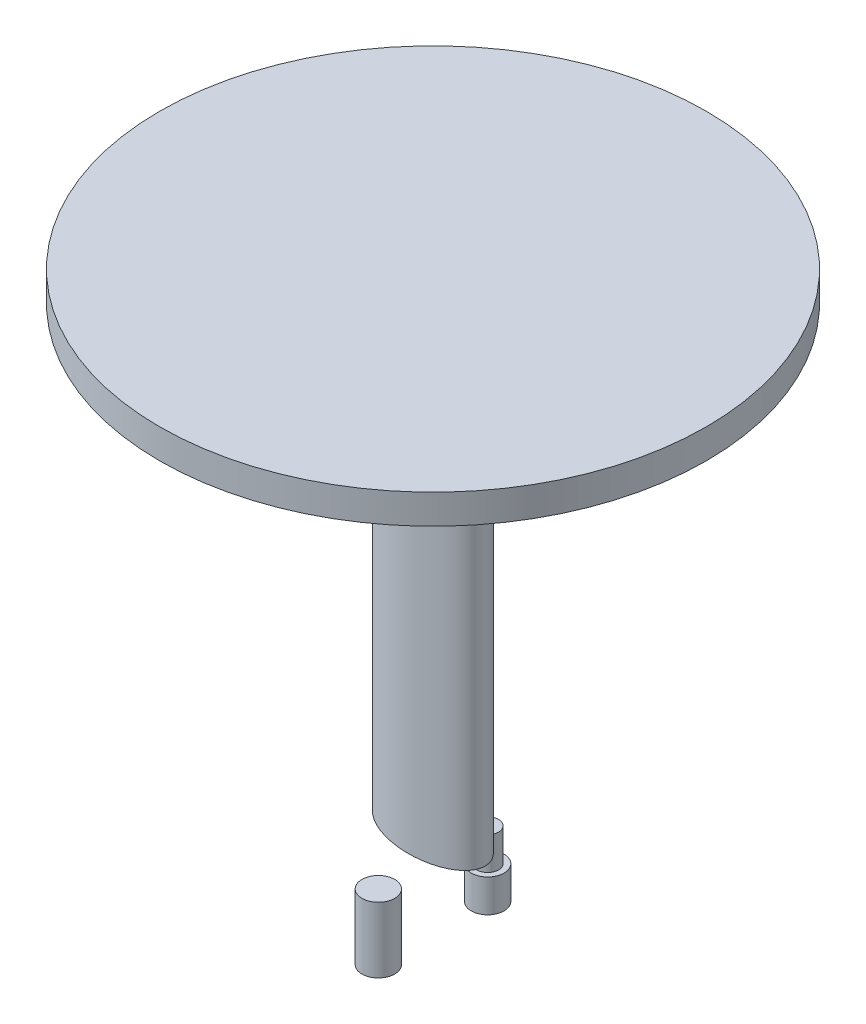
from build123d import *

# Parameters (mm, degrees)
SZKIC2_R                      = 1.5
DODANIE_WYCI_GNI_CIE1_DEPTH   = 6
DODANIE_WYCI_GNI_CIE1_2_DEPTH = 6
WYTNIJ_WYCI_GNI_CIE2_START    = -3
SZKIC3_R                      = 2.37273906
SZKIC3_R_2                    = 1
SZKIC3_R_3                    = 1.5
WYTNIJ_WYCI_GNI_CIE2_DEPTH    = 3
SZKIC5_RX                     = 5.094448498
SZKIC5_RY                     = 2.808526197
DODANIE_WYCI_GNI_CIE3_DEPTH   = 31


with BuildPart() as part:
    # Szkic1 → Obr_t1 (revolve)
    with BuildSketch(Plane.XY, mode=Mode.PRIVATE) as obr_t1_sk:
        Polygon((23.5, 43.9), (0, 43.9), (0, 46.6), (23.5, 46.6), (25, 46.6), (25, 43.9), align=None)
    revolve(obr_t1_sk.sketch.rotate(Axis((0, 0, 0), (0, 1, 0)), 90), axis=Axis((0, 0, 0), (0, 1, 0)))


with BuildPart() as body_2:
    # Szkic2 → Dodanie-wyci_gni_cie1 (new body)
    with BuildSketch(Plane.XZ):
        with Locations(Location((0, 5, 0), (0, 0, 270))):
            Circle(SZKIC2_R)
    extrude(amount=DODANIE_WYCI_GNI_CIE1_DEPTH)


with BuildPart() as body_3:
    # Szkic2 → Dodanie-wyci_gni_cie1 2 (new body)
    with BuildSketch(Plane.XZ):
        with Locations(Location((0, -5, 0), (0, 0, 270))):
            Circle(SZKIC2_R)
    extrude(amount=DODANIE_WYCI_GNI_CIE1_2_DEPTH)

    # Szkic3 → Wytnij-wyci_gni_cie2 (cut)
    # profile 1 of 2: a face of its own
    with BuildSketch(Plane.XZ.offset(6).offset(WYTNIJ_WYCI_GNI_CIE2_START)):
        with Locations((0, 5)):
            Circle(SZKIC3_R)
        with Locations((0, 5)):
            Circle(SZKIC3_R_2, mode=Mode.SUBTRACT)
    # profile 2 of 2: a face of its own
    with BuildSketch(Plane.XZ.offset(6).offset(WYTNIJ_WYCI_GNI_CIE2_START)):
        with Locations(Location((0, -5, 0), (0, 0, 270))):
            Circle(SZKIC3_R_3)
        with Locations(Location((0, -5, 0), (0, 0, 270))):
            Circle(SZKIC3_R_2, mode=Mode.SUBTRACT)
    extrude(amount=-WYTNIJ_WYCI_GNI_CIE2_DEPTH, mode=Mode.SUBTRACT)


with BuildPart() as body_4:
    # Szkic5 → Dodanie-wyci_gni_cie3 (new body)
    with BuildSketch(Plane(origin=(0, 2, 0), x_dir=(1, 0, 0), z_dir=(0, 1, 0))):
        with Locations(Location((0, 0), (0, 0, -5.241327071))):
            Ellipse(SZKIC5_RX, SZKIC5_RY)
    extrude(amount=DODANIE_WYCI_GNI_CIE3_DEPTH)


solid = Compound([part.part, body_2.part, body_3.part, body_4.part])
